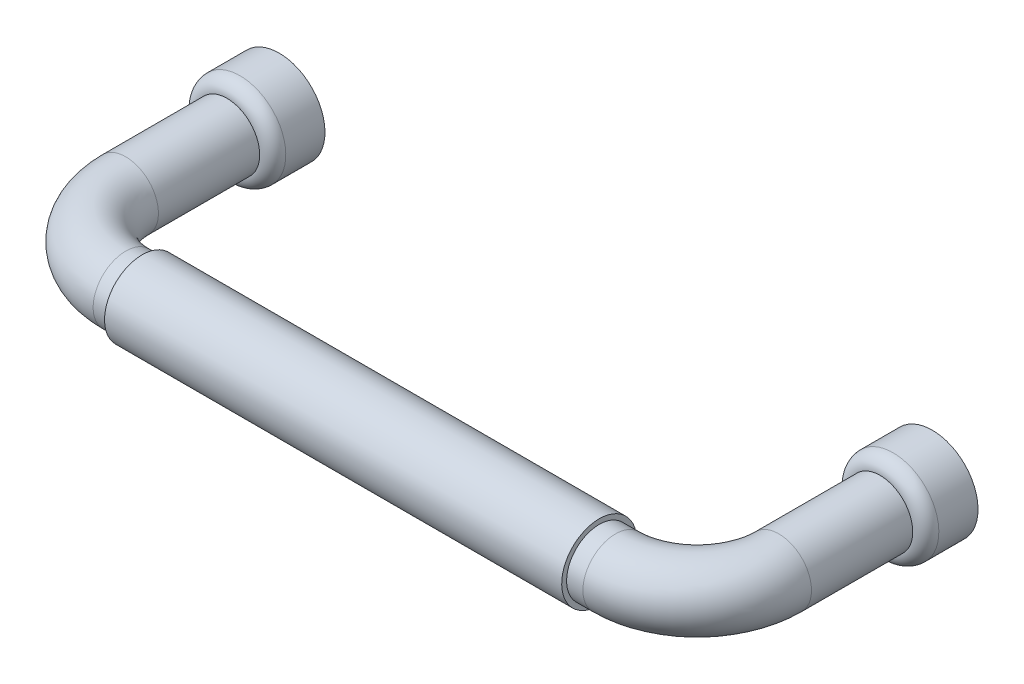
ISO-10303-21;
HEADER;
FILE_DESCRIPTION(('STEP AP214'),'2;1');
FILE_NAME('part.step','',(''),(''),'','','');
FILE_SCHEMA(('AUTOMOTIVE_DESIGN { 1 0 10303 214 1 1 1 1 }'));
ENDSEC;
DATA;
#1=APPLICATION_CONTEXT('core data for automotive mechanical design processes');
#2=APPLICATION_PROTOCOL_DEFINITION('international standard','automotive_design',2000,#1);
#3=PRODUCT_CONTEXT('',#1,'mechanical');
#4=PRODUCT('Part','Part','',(#3));
#5=PRODUCT_RELATED_PRODUCT_CATEGORY('part','',(#4));
#6=PRODUCT_DEFINITION_FORMATION('','',#4);
#7=PRODUCT_DEFINITION_CONTEXT('part definition',#1,'design');
#8=PRODUCT_DEFINITION('design','',#6,#7);
#9=PRODUCT_DEFINITION_SHAPE('','',#8);
#10=(LENGTH_UNIT() NAMED_UNIT(*) SI_UNIT(.MILLI.,.METRE.));
#11=(NAMED_UNIT(*) PLANE_ANGLE_UNIT() SI_UNIT($,.RADIAN.));
#12=(NAMED_UNIT(*) SI_UNIT($,.STERADIAN.) SOLID_ANGLE_UNIT());
#13=UNCERTAINTY_MEASURE_WITH_UNIT(LENGTH_MEASURE(1.E-05),#10,'distance_accuracy_value','');
#14=(GEOMETRIC_REPRESENTATION_CONTEXT(3) GLOBAL_UNCERTAINTY_ASSIGNED_CONTEXT((#13)) GLOBAL_UNIT_ASSIGNED_CONTEXT((#10,
#11,#12)) REPRESENTATION_CONTEXT('',''));
#15=CARTESIAN_POINT('',(0.,0.,0.));
#16=DIRECTION('',(0.,0.,1.));
#17=DIRECTION('',(1.,0.,0.));
#18=AXIS2_PLACEMENT_3D('',#15,#16,#17);
#19=CARTESIAN_POINT('',(0.,0.,0.));
#20=DIRECTION('',(0.,0.,-1.));
#21=DIRECTION('',(0.,1.,0.));
#22=AXIS2_PLACEMENT_3D('',#19,#20,#21);
#23=PLANE('',#22);
#24=CARTESIAN_POINT('',(0.,0.,0.));
#25=DIRECTION('',(0.,0.,1.));
#26=DIRECTION('',(0.,-1.,0.));
#27=AXIS2_PLACEMENT_3D('',#24,#25,#26);
#28=CIRCLE('',#27,7.00045758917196);
#29=CARTESIAN_POINT('',(0.,-7.00045758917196,0.));
#30=VERTEX_POINT('',#29);
#31=EDGE_CURVE('E295',#30,#30,#28,.T.);
#32=ORIENTED_EDGE('',*,*,#31,.F.);
#33=EDGE_LOOP('',(#32));
#34=FACE_BOUND('',#33,.T.);
#35=CARTESIAN_POINT('',(0.,0.,0.));
#36=DIRECTION('',(0.,0.,1.));
#37=DIRECTION('',(0.,-1.,0.));
#38=AXIS2_PLACEMENT_3D('',#35,#36,#37);
#39=CIRCLE('',#38,2.5);
#40=CARTESIAN_POINT('',(0.,-2.5,0.));
#41=VERTEX_POINT('',#40);
#42=EDGE_CURVE('E285',#41,#41,#39,.T.);
#43=ORIENTED_EDGE('',*,*,#42,.T.);
#44=EDGE_LOOP('',(#43));
#45=FACE_BOUND('',#44,.T.);
#46=ADVANCED_FACE('F12',(#34,#45),#23,.T.);
#47=CARTESIAN_POINT('',(87.5,0.,36.));
#48=DIRECTION('',(-1.,0.,0.));
#49=DIRECTION('',(0.,0.,1.));
#50=AXIS2_PLACEMENT_3D('',#47,#48,#49);
#51=CYLINDRICAL_SURFACE('',#50,5.);
#52=CARTESIAN_POINT('',(85.,0.,36.));
#53=DIRECTION('',(1.,0.,0.));
#54=DIRECTION('',(0.,1.,0.));
#55=AXIS2_PLACEMENT_3D('',#52,#53,#54);
#56=CIRCLE('',#55,5.);
#57=CARTESIAN_POINT('',(85.,5.,36.));
#58=VERTEX_POINT('',#57);
#59=EDGE_CURVE('E19',#58,#58,#56,.F.);
#60=ORIENTED_EDGE('',*,*,#59,.F.);
#61=EDGE_LOOP('',(#60));
#62=FACE_BOUND('',#61,.T.);
#63=CARTESIAN_POINT('',(87.5,0.,36.));
#64=DIRECTION('',(-1.,0.,0.));
#65=DIRECTION('',(0.,1.,0.));
#66=AXIS2_PLACEMENT_3D('',#63,#64,#65);
#67=CIRCLE('',#66,5.);
#68=CARTESIAN_POINT('',(87.5,0.,41.));
#69=VERTEX_POINT('',#68);
#70=EDGE_CURVE('E55',#69,#69,#67,.T.);
#71=ORIENTED_EDGE('',*,*,#70,.T.);
#72=EDGE_LOOP('',(#71));
#73=FACE_BOUND('',#72,.T.);
#74=ADVANCED_FACE('F77',(#62,#73),#51,.T.);
#75=CARTESIAN_POINT('',(87.5,0.,23.5));
#76=DIRECTION('',(0.,-1.,0.));
#77=DIRECTION('',(1.,0.,0.));
#78=AXIS2_PLACEMENT_3D('',#75,#76,#77);
#79=TOROIDAL_SURFACE('',#78,12.5,5.);
#80=CARTESIAN_POINT('',(100.,0.,23.5));
#81=DIRECTION('',(0.,0.,1.));
#82=DIRECTION('',(0.,1.,0.));
#83=AXIS2_PLACEMENT_3D('',#80,#81,#82);
#84=CIRCLE('',#83,5.);
#85=CARTESIAN_POINT('',(105.,0.,23.5));
#86=VERTEX_POINT('',#85);
#87=EDGE_CURVE('E52',#86,#86,#84,.T.);
#88=CARTESIAN_POINT('',(87.5,0.,23.5));
#89=DIRECTION('',(0.,-1.,0.));
#90=DIRECTION('',(1.,0.,0.));
#91=AXIS2_PLACEMENT_3D('',#88,#89,#90);
#92=CIRCLE('',#91,17.5);
#93=EDGE_CURVE('',#86,#69,#92,.T.);
#94=ORIENTED_EDGE('',*,*,#87,.T.);
#95=ORIENTED_EDGE('',*,*,#70,.F.);
#96=ORIENTED_EDGE('',*,*,#93,.T.);
#97=ORIENTED_EDGE('',*,*,#93,.F.);
#98=EDGE_LOOP('',(#94,#96,#95,#97));
#99=FACE_BOUND('',#98,.T.);
#100=ADVANCED_FACE('F87',(#99),#79,.T.);
#101=CARTESIAN_POINT('',(100.,0.,23.5));
#102=DIRECTION('',(0.,0.,-1.));
#103=DIRECTION('',(0.,-1.,0.));
#104=AXIS2_PLACEMENT_3D('',#101,#102,#103);
#105=CYLINDRICAL_SURFACE('',#104,5.);
#106=CARTESIAN_POINT('',(100.,0.,7.99921137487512));
#107=DIRECTION('',(0.,0.,1.));
#108=DIRECTION('',(0.,1.,0.));
#109=AXIS2_PLACEMENT_3D('',#106,#107,#108);
#110=CIRCLE('',#109,5.);
#111=CARTESIAN_POINT('',(100.,5.,7.99921137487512));
#112=VERTEX_POINT('',#111);
#113=EDGE_CURVE('E31',#112,#112,#110,.T.);
#114=ORIENTED_EDGE('',*,*,#113,.T.);
#115=EDGE_LOOP('',(#114));
#116=FACE_BOUND('',#115,.T.);
#117=ORIENTED_EDGE('',*,*,#87,.F.);
#118=EDGE_LOOP('',(#117));
#119=FACE_BOUND('',#118,.T.);
#120=ADVANCED_FACE('F95',(#116,#119),#105,.T.);
#121=CARTESIAN_POINT('',(85.,0.,36.));
#122=DIRECTION('',(1.,0.,0.));
#123=DIRECTION('',(0.,1.,0.));
#124=AXIS2_PLACEMENT_3D('',#121,#122,#123);
#125=PLANE('',#124);
#126=ORIENTED_EDGE('',*,*,#59,.T.);
#127=EDGE_LOOP('',(#126));
#128=FACE_BOUND('',#127,.T.);
#129=CARTESIAN_POINT('',(85.,0.,36.));
#130=DIRECTION('',(1.,0.,0.));
#131=DIRECTION('',(0.,1.,0.));
#132=AXIS2_PLACEMENT_3D('',#129,#130,#131);
#133=CIRCLE('',#132,5.75);
#134=CARTESIAN_POINT('',(85.,5.75,36.));
#135=VERTEX_POINT('',#134);
#136=EDGE_CURVE('E38',#135,#135,#133,.T.);
#137=ORIENTED_EDGE('',*,*,#136,.T.);
#138=EDGE_LOOP('',(#137));
#139=FACE_BOUND('',#138,.T.);
#140=ADVANCED_FACE('F98',(#128,#139),#125,.T.);
#141=CARTESIAN_POINT('',(65.8852693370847,0.,36.));
#142=DIRECTION('',(1.,0.,0.));
#143=DIRECTION('',(0.,1.,0.));
#144=AXIS2_PLACEMENT_3D('',#141,#142,#143);
#145=CYLINDRICAL_SURFACE('',#144,5.75);
#146=ORIENTED_EDGE('',*,*,#136,.F.);
#147=EDGE_LOOP('',(#146));
#148=FACE_BOUND('',#147,.T.);
#149=CARTESIAN_POINT('',(15.,0.,36.));
#150=DIRECTION('',(1.,0.,0.));
#151=DIRECTION('',(0.,1.,0.));
#152=AXIS2_PLACEMENT_3D('',#149,#150,#151);
#153=CIRCLE('',#152,5.75);
#154=CARTESIAN_POINT('',(15.,5.75,36.));
#155=VERTEX_POINT('',#154);
#156=EDGE_CURVE('E33',#155,#155,#153,.T.);
#157=ORIENTED_EDGE('',*,*,#156,.T.);
#158=EDGE_LOOP('',(#157));
#159=FACE_BOUND('',#158,.T.);
#160=ADVANCED_FACE('F127',(#148,#159),#145,.T.);
#161=CARTESIAN_POINT('',(15.,0.,41.75));
#162=DIRECTION('',(-1.,0.,0.));
#163=DIRECTION('',(0.,-1.,0.));
#164=AXIS2_PLACEMENT_3D('',#161,#162,#163);
#165=PLANE('',#164);
#166=CARTESIAN_POINT('',(15.,0.,36.));
#167=DIRECTION('',(-1.,0.,0.));
#168=DIRECTION('',(0.,-1.,0.));
#169=AXIS2_PLACEMENT_3D('',#166,#167,#168);
#170=CIRCLE('',#169,5.);
#171=CARTESIAN_POINT('',(15.,-5.,36.));
#172=VERTEX_POINT('',#171);
#173=EDGE_CURVE('E23',#172,#172,#170,.F.);
#174=ORIENTED_EDGE('',*,*,#173,.T.);
#175=EDGE_LOOP('',(#174));
#176=FACE_BOUND('',#175,.T.);
#177=ORIENTED_EDGE('',*,*,#156,.F.);
#178=EDGE_LOOP('',(#177));
#179=FACE_BOUND('',#178,.T.);
#180=ADVANCED_FACE('F78',(#176,#179),#165,.T.);
#181=CARTESIAN_POINT('',(0.,0.,23.5));
#182=DIRECTION('',(0.,0.,-1.));
#183=DIRECTION('',(-1.,0.,0.));
#184=AXIS2_PLACEMENT_3D('',#181,#182,#183);
#185=CYLINDRICAL_SURFACE('',#184,5.);
#186=CARTESIAN_POINT('',(0.,0.,7.99921137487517));
#187=DIRECTION('',(0.,0.,1.));
#188=DIRECTION('',(0.,1.,0.));
#189=AXIS2_PLACEMENT_3D('',#186,#187,#188);
#190=CIRCLE('',#189,5.);
#191=CARTESIAN_POINT('',(0.,5.,7.99921137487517));
#192=VERTEX_POINT('',#191);
#193=EDGE_CURVE('E8',#192,#192,#190,.F.);
#194=ORIENTED_EDGE('',*,*,#193,.F.);
#195=EDGE_LOOP('',(#194));
#196=FACE_BOUND('',#195,.T.);
#197=CARTESIAN_POINT('',(0.,0.,23.5));
#198=DIRECTION('',(0.,0.,-1.));
#199=DIRECTION('',(0.,1.,0.));
#200=AXIS2_PLACEMENT_3D('',#197,#198,#199);
#201=CIRCLE('',#200,5.);
#202=CARTESIAN_POINT('',(-5.,0.,23.5));
#203=VERTEX_POINT('',#202);
#204=EDGE_CURVE('E28',#203,#203,#201,.T.);
#205=ORIENTED_EDGE('',*,*,#204,.T.);
#206=EDGE_LOOP('',(#205));
#207=FACE_BOUND('',#206,.T.);
#208=ADVANCED_FACE('F14',(#196,#207),#185,.T.);
#209=CARTESIAN_POINT('',(12.5,0.,23.5));
#210=DIRECTION('',(0.,-1.,0.));
#211=DIRECTION('',(1.,0.,0.));
#212=AXIS2_PLACEMENT_3D('',#209,#210,#211);
#213=TOROIDAL_SURFACE('',#212,12.5,5.);
#214=CARTESIAN_POINT('',(12.5,0.,36.));
#215=DIRECTION('',(-1.,0.,0.));
#216=DIRECTION('',(0.,1.,0.));
#217=AXIS2_PLACEMENT_3D('',#214,#215,#216);
#218=CIRCLE('',#217,5.);
#219=CARTESIAN_POINT('',(12.5,0.,41.));
#220=VERTEX_POINT('',#219);
#221=EDGE_CURVE('E58',#220,#220,#218,.T.);
#222=CARTESIAN_POINT('',(12.5,0.,23.5));
#223=DIRECTION('',(0.,-1.,0.));
#224=DIRECTION('',(1.,0.,0.));
#225=AXIS2_PLACEMENT_3D('',#222,#223,#224);
#226=CIRCLE('',#225,17.5);
#227=EDGE_CURVE('',#220,#203,#226,.T.);
#228=ORIENTED_EDGE('',*,*,#221,.T.);
#229=ORIENTED_EDGE('',*,*,#204,.F.);
#230=ORIENTED_EDGE('',*,*,#227,.T.);
#231=ORIENTED_EDGE('',*,*,#227,.F.);
#232=EDGE_LOOP('',(#228,#230,#229,#231));
#233=FACE_BOUND('',#232,.T.);
#234=ADVANCED_FACE('F64',(#233),#213,.T.);
#235=ORIENTED_EDGE('',*,*,#173,.F.);
#236=EDGE_LOOP('',(#235));
#237=FACE_BOUND('',#236,.T.);
#238=ORIENTED_EDGE('',*,*,#221,.F.);
#239=EDGE_LOOP('',(#238));
#240=FACE_BOUND('',#239,.T.);
#241=ADVANCED_FACE('F66',(#237,#240),#51,.T.);
#242=CARTESIAN_POINT('',(94.9995424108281,0.,7.99921137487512));
#243=DIRECTION('',(0.,0.,1.));
#244=DIRECTION('',(0.,1.,0.));
#245=AXIS2_PLACEMENT_3D('',#242,#243,#244);
#246=PLANE('',#245);
#247=CARTESIAN_POINT('',(100.,0.,7.99921137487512));
#248=DIRECTION('',(0.,0.,-1.));
#249=DIRECTION('',(0.,-1.,0.));
#250=AXIS2_PLACEMENT_3D('',#247,#248,#249);
#251=CIRCLE('',#250,5.00045758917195);
#252=CARTESIAN_POINT('',(100.,-5.00045758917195,7.99921137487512));
#253=VERTEX_POINT('',#252);
#254=EDGE_CURVE('E46',#253,#253,#251,.T.);
#255=ORIENTED_EDGE('',*,*,#254,.F.);
#256=EDGE_LOOP('',(#255));
#257=FACE_BOUND('',#256,.T.);
#258=ORIENTED_EDGE('',*,*,#113,.F.);
#259=EDGE_LOOP('',(#258));
#260=FACE_BOUND('',#259,.T.);
#261=ADVANCED_FACE('F74',(#257,#260),#246,.T.);
#262=CARTESIAN_POINT('',(100.,0.,0.));
#263=DIRECTION('',(0.,0.,-1.));
#264=DIRECTION('',(0.,-1.,0.));
#265=AXIS2_PLACEMENT_3D('',#262,#263,#264);
#266=CYLINDRICAL_SURFACE('',#265,7.00045758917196);
#267=CARTESIAN_POINT('',(100.,0.,5.99921137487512));
#268=DIRECTION('',(0.,0.,-1.));
#269=DIRECTION('',(0.,-1.,0.));
#270=AXIS2_PLACEMENT_3D('',#267,#268,#269);
#271=CIRCLE('',#270,7.00045758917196);
#272=CARTESIAN_POINT('',(100.,-7.00045758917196,5.99921137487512));
#273=VERTEX_POINT('',#272);
#274=EDGE_CURVE('E41',#273,#273,#271,.T.);
#275=ORIENTED_EDGE('',*,*,#274,.T.);
#276=EDGE_LOOP('',(#275));
#277=FACE_BOUND('',#276,.T.);
#278=CARTESIAN_POINT('',(100.,0.,0.));
#279=DIRECTION('',(0.,0.,-1.));
#280=DIRECTION('',(0.,-1.,0.));
#281=AXIS2_PLACEMENT_3D('',#278,#279,#280);
#282=CIRCLE('',#281,7.00045758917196);
#283=CARTESIAN_POINT('',(100.,-7.00045758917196,0.));
#284=VERTEX_POINT('',#283);
#285=EDGE_CURVE('E34',#284,#284,#282,.T.);
#286=ORIENTED_EDGE('',*,*,#285,.F.);
#287=EDGE_LOOP('',(#286));
#288=FACE_BOUND('',#287,.T.);
#289=ADVANCED_FACE('F181',(#277,#288),#266,.T.);
#290=CARTESIAN_POINT('',(100.,0.,5.99921137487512));
#291=DIRECTION('',(0.,0.,-1.));
#292=DIRECTION('',(0.,-1.,0.));
#293=AXIS2_PLACEMENT_3D('',#290,#291,#292);
#294=TOROIDAL_SURFACE('',#293,5.00045758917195,2.);
#295=ORIENTED_EDGE('',*,*,#254,.T.);
#296=EDGE_LOOP('',(#295));
#297=FACE_BOUND('',#296,.T.);
#298=ORIENTED_EDGE('',*,*,#274,.F.);
#299=EDGE_LOOP('',(#298));
#300=FACE_BOUND('',#299,.T.);
#301=ADVANCED_FACE('F189',(#297,#300),#294,.T.);
#302=CARTESIAN_POINT('',(100.,0.,0.));
#303=DIRECTION('',(0.,0.,1.));
#304=DIRECTION('',(0.,1.,0.));
#305=AXIS2_PLACEMENT_3D('',#302,#303,#304);
#306=PLANE('',#305);
#307=CARTESIAN_POINT('',(100.,0.,0.));
#308=DIRECTION('',(0.,0.,-1.));
#309=DIRECTION('',(0.,-1.,0.));
#310=AXIS2_PLACEMENT_3D('',#307,#308,#309);
#311=CIRCLE('',#310,2.5);
#312=CARTESIAN_POINT('',(100.,-2.5,0.));
#313=VERTEX_POINT('',#312);
#314=EDGE_CURVE('E298',#313,#313,#311,.T.);
#315=ORIENTED_EDGE('',*,*,#314,.F.);
#316=EDGE_LOOP('',(#315));
#317=FACE_BOUND('',#316,.T.);
#318=ORIENTED_EDGE('',*,*,#285,.T.);
#319=EDGE_LOOP('',(#318));
#320=FACE_BOUND('',#319,.T.);
#321=ADVANCED_FACE('F93',(#317,#320),#306,.F.);
#322=CARTESIAN_POINT('',(100.,0.,11.));
#323=DIRECTION('',(0.,0.,-1.));
#324=DIRECTION('',(0.,-1.,0.));
#325=AXIS2_PLACEMENT_3D('',#322,#323,#324);
#326=CYLINDRICAL_SURFACE('',#325,2.5);
#327=CARTESIAN_POINT('',(100.,0.,11.));
#328=DIRECTION('',(0.,0.,-1.));
#329=DIRECTION('',(0.,-1.,0.));
#330=AXIS2_PLACEMENT_3D('',#327,#328,#329);
#331=CIRCLE('',#330,2.5);
#332=CARTESIAN_POINT('',(100.,-2.5,11.));
#333=VERTEX_POINT('',#332);
#334=EDGE_CURVE('E301',#333,#333,#331,.T.);
#335=ORIENTED_EDGE('',*,*,#334,.F.);
#336=EDGE_LOOP('',(#335));
#337=FACE_BOUND('',#336,.T.);
#338=ORIENTED_EDGE('',*,*,#314,.T.);
#339=EDGE_LOOP('',(#338));
#340=FACE_BOUND('',#339,.T.);
#341=ADVANCED_FACE('F206',(#337,#340),#326,.F.);
#342=CARTESIAN_POINT('',(100.,0.,11.));
#343=DIRECTION('',(0.,0.,-1.));
#344=DIRECTION('',(0.,-1.,0.));
#345=AXIS2_PLACEMENT_3D('',#342,#343,#344);
#346=PLANE('',#345);
#347=ORIENTED_EDGE('',*,*,#334,.T.);
#348=EDGE_LOOP('',(#347));
#349=FACE_BOUND('',#348,.T.);
#350=ADVANCED_FACE('F208',(#349),#346,.T.);
#351=CARTESIAN_POINT('',(0.,0.,0.));
#352=DIRECTION('',(0.,0.,-1.));
#353=DIRECTION('',(0.,-1.,0.));
#354=AXIS2_PLACEMENT_3D('',#351,#352,#353);
#355=CYLINDRICAL_SURFACE('',#354,7.00045758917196);
#356=CARTESIAN_POINT('',(0.,0.,5.99921137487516));
#357=DIRECTION('',(0.,0.,1.));
#358=DIRECTION('',(0.,-1.,0.));
#359=AXIS2_PLACEMENT_3D('',#356,#357,#358);
#360=CIRCLE('',#359,7.00045758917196);
#361=CARTESIAN_POINT('',(0.,-7.00045758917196,5.99921137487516));
#362=VERTEX_POINT('',#361);
#363=EDGE_CURVE('E288',#362,#362,#360,.T.);
#364=ORIENTED_EDGE('',*,*,#363,.F.);
#365=EDGE_LOOP('',(#364));
#366=FACE_BOUND('',#365,.T.);
#367=ORIENTED_EDGE('',*,*,#31,.T.);
#368=EDGE_LOOP('',(#367));
#369=FACE_BOUND('',#368,.T.);
#370=ADVANCED_FACE('F217',(#366,#369),#355,.T.);
#371=CARTESIAN_POINT('',(0.,0.,5.99921137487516));
#372=DIRECTION('',(0.,0.,-1.));
#373=DIRECTION('',(0.,-1.,0.));
#374=AXIS2_PLACEMENT_3D('',#371,#372,#373);
#375=TOROIDAL_SURFACE('',#374,5.00045758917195,2.);
#376=CARTESIAN_POINT('',(0.,0.,7.99921137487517));
#377=DIRECTION('',(0.,0.,1.));
#378=DIRECTION('',(0.,-1.,0.));
#379=AXIS2_PLACEMENT_3D('',#376,#377,#378);
#380=CIRCLE('',#379,5.00045758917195);
#381=CARTESIAN_POINT('',(0.,-5.00045758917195,7.99921137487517));
#382=VERTEX_POINT('',#381);
#383=EDGE_CURVE('E284',#382,#382,#380,.T.);
#384=ORIENTED_EDGE('',*,*,#383,.F.);
#385=EDGE_LOOP('',(#384));
#386=FACE_BOUND('',#385,.T.);
#387=ORIENTED_EDGE('',*,*,#363,.T.);
#388=EDGE_LOOP('',(#387));
#389=FACE_BOUND('',#388,.T.);
#390=ADVANCED_FACE('F232',(#386,#389),#375,.T.);
#391=CARTESIAN_POINT('',(5.00045758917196,0.,7.99921137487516));
#392=DIRECTION('',(0.,0.,1.));
#393=DIRECTION('',(0.,1.,0.));
#394=AXIS2_PLACEMENT_3D('',#391,#392,#393);
#395=PLANE('',#394);
#396=ORIENTED_EDGE('',*,*,#193,.T.);
#397=EDGE_LOOP('',(#396));
#398=FACE_BOUND('',#397,.T.);
#399=ORIENTED_EDGE('',*,*,#383,.T.);
#400=EDGE_LOOP('',(#399));
#401=FACE_BOUND('',#400,.T.);
#402=ADVANCED_FACE('F241',(#398,#401),#395,.T.);
#403=CARTESIAN_POINT('',(0.,0.,11.));
#404=DIRECTION('',(0.,0.,-1.));
#405=DIRECTION('',(0.,-1.,0.));
#406=AXIS2_PLACEMENT_3D('',#403,#404,#405);
#407=CYLINDRICAL_SURFACE('',#406,2.5);
#408=CARTESIAN_POINT('',(0.,0.,11.));
#409=DIRECTION('',(0.,0.,1.));
#410=DIRECTION('',(0.,-1.,0.));
#411=AXIS2_PLACEMENT_3D('',#408,#409,#410);
#412=CIRCLE('',#411,2.5);
#413=CARTESIAN_POINT('',(0.,-2.5,11.));
#414=VERTEX_POINT('',#413);
#415=EDGE_CURVE('E283',#414,#414,#412,.T.);
#416=ORIENTED_EDGE('',*,*,#415,.T.);
#417=EDGE_LOOP('',(#416));
#418=FACE_BOUND('',#417,.T.);
#419=ORIENTED_EDGE('',*,*,#42,.F.);
#420=EDGE_LOOP('',(#419));
#421=FACE_BOUND('',#420,.T.);
#422=ADVANCED_FACE('F250',(#418,#421),#407,.F.);
#423=CARTESIAN_POINT('',(0.,0.,11.));
#424=DIRECTION('',(0.,0.,-1.));
#425=DIRECTION('',(0.,-1.,0.));
#426=AXIS2_PLACEMENT_3D('',#423,#424,#425);
#427=PLANE('',#426);
#428=ORIENTED_EDGE('',*,*,#415,.F.);
#429=EDGE_LOOP('',(#428));
#430=FACE_BOUND('',#429,.T.);
#431=ADVANCED_FACE('F252',(#430),#427,.T.);
#432=CLOSED_SHELL('',(#46,#74,#100,#120,#140,#160,#180,#208,#234,#241,#261,#289,#301,#321,#341,
#350,#370,#390,#402,#422,#431));
#433=MANIFOLD_SOLID_BREP('B1',#432);
#434=ADVANCED_BREP_SHAPE_REPRESENTATION('',(#18,#433),#14);
#435=SHAPE_DEFINITION_REPRESENTATION(#9,#434);
ENDSEC;
END-ISO-10303-21;
